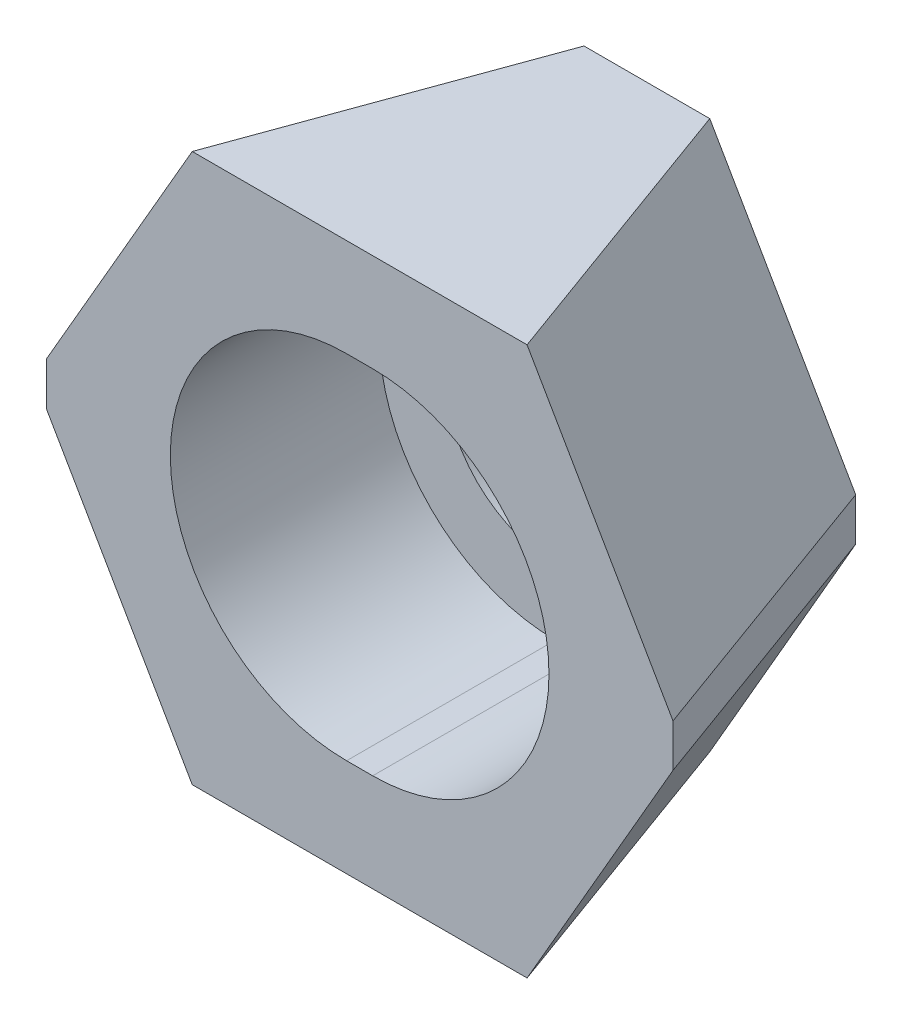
ISO-10303-21;
HEADER;
FILE_DESCRIPTION(('STEP AP214'),'2;1');
FILE_NAME('part.step','',(''),(''),'','','');
FILE_SCHEMA(('AUTOMOTIVE_DESIGN { 1 0 10303 214 1 1 1 1 }'));
ENDSEC;
DATA;
#1=APPLICATION_CONTEXT('core data for automotive mechanical design processes');
#2=APPLICATION_PROTOCOL_DEFINITION('international standard','automotive_design',2000,#1);
#3=PRODUCT_CONTEXT('',#1,'mechanical');
#4=PRODUCT('Part','Part','',(#3));
#5=PRODUCT_RELATED_PRODUCT_CATEGORY('part','',(#4));
#6=PRODUCT_DEFINITION_FORMATION('','',#4);
#7=PRODUCT_DEFINITION_CONTEXT('part definition',#1,'design');
#8=PRODUCT_DEFINITION('design','',#6,#7);
#9=PRODUCT_DEFINITION_SHAPE('','',#8);
#10=(LENGTH_UNIT() NAMED_UNIT(*) SI_UNIT(.MILLI.,.METRE.));
#11=(NAMED_UNIT(*) PLANE_ANGLE_UNIT() SI_UNIT($,.RADIAN.));
#12=(NAMED_UNIT(*) SI_UNIT($,.STERADIAN.) SOLID_ANGLE_UNIT());
#13=UNCERTAINTY_MEASURE_WITH_UNIT(LENGTH_MEASURE(1.E-05),#10,'distance_accuracy_value','');
#14=(GEOMETRIC_REPRESENTATION_CONTEXT(3) GLOBAL_UNCERTAINTY_ASSIGNED_CONTEXT((#13)) GLOBAL_UNIT_ASSIGNED_CONTEXT((#10,
#11,#12)) REPRESENTATION_CONTEXT('',''));
#15=CARTESIAN_POINT('',(0.,0.,0.));
#16=DIRECTION('',(0.,0.,1.));
#17=DIRECTION('',(1.,0.,0.));
#18=AXIS2_PLACEMENT_3D('',#15,#16,#17);
#19=CARTESIAN_POINT('',(13.,10.5,11.));
#20=DIRECTION('',(0.,0.,1.));
#21=DIRECTION('',(1.,0.,0.));
#22=AXIS2_PLACEMENT_3D('',#19,#20,#21);
#23=PLANE('',#22);
#24=DIRECTION('',(-1.,0.,0.));
#25=VECTOR('',#24,1.);
#26=CARTESIAN_POINT('',(-0.5,6.75,11.));
#27=LINE('',#26,#25);
#28=CARTESIAN_POINT('',(0.5,6.75,11.));
#29=VERTEX_POINT('',#28);
#30=CARTESIAN_POINT('',(-0.5,6.75,11.));
#31=VERTEX_POINT('',#30);
#32=EDGE_CURVE('E189',#29,#31,#27,.T.);
#33=ORIENTED_EDGE('',*,*,#32,.F.);
#34=CARTESIAN_POINT('',(0.5,0.,11.));
#35=DIRECTION('',(0.,0.,1.));
#36=DIRECTION('',(1.,0.,0.));
#37=AXIS2_PLACEMENT_3D('',#34,#35,#36);
#38=CIRCLE('',#37,6.75);
#39=CARTESIAN_POINT('',(0.5,-6.75,11.));
#40=VERTEX_POINT('',#39);
#41=EDGE_CURVE('E186',#40,#29,#38,.T.);
#42=ORIENTED_EDGE('',*,*,#41,.F.);
#43=DIRECTION('',(1.,0.,0.));
#44=VECTOR('',#43,1.);
#45=CARTESIAN_POINT('',(-0.5,-6.75,11.));
#46=LINE('',#45,#44);
#47=CARTESIAN_POINT('',(-0.5,-6.75,11.));
#48=VERTEX_POINT('',#47);
#49=EDGE_CURVE('E184',#48,#40,#46,.T.);
#50=ORIENTED_EDGE('',*,*,#49,.F.);
#51=CARTESIAN_POINT('',(-0.5,0.,11.));
#52=DIRECTION('',(0.,0.,1.));
#53=DIRECTION('',(1.,0.,0.));
#54=AXIS2_PLACEMENT_3D('',#51,#52,#53);
#55=CIRCLE('',#54,6.75);
#56=EDGE_CURVE('E168',#31,#48,#55,.T.);
#57=ORIENTED_EDGE('',*,*,#56,.F.);
#58=EDGE_LOOP('',(#33,#42,#50,#57));
#59=FACE_BOUND('',#58,.T.);
#60=DIRECTION('',(0.5,-0.86602540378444,0.));
#61=VECTOR('',#60,1.);
#62=CARTESIAN_POINT('',(6.41124939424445,10.5,11.));
#63=LINE('',#62,#61);
#64=CARTESIAN_POINT('',(6.41124939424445,10.5,11.));
#65=VERTEX_POINT('',#64);
#66=CARTESIAN_POINT('',(12.,0.82,11.));
#67=VERTEX_POINT('',#66);
#68=EDGE_CURVE('E212',#65,#67,#63,.T.);
#69=ORIENTED_EDGE('',*,*,#68,.F.);
#70=DIRECTION('',(-1.,0.,0.));
#71=VECTOR('',#70,1.);
#72=CARTESIAN_POINT('',(13.,10.5,11.));
#73=LINE('',#72,#71);
#74=CARTESIAN_POINT('',(-6.41124939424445,10.5,11.));
#75=VERTEX_POINT('',#74);
#76=EDGE_CURVE('E18',#65,#75,#73,.T.);
#77=ORIENTED_EDGE('',*,*,#76,.T.);
#78=DIRECTION('',(-0.5,-0.86602540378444,0.));
#79=VECTOR('',#78,1.);
#80=CARTESIAN_POINT('',(-6.41124939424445,10.5,11.));
#81=LINE('',#80,#79);
#82=CARTESIAN_POINT('',(-12.,0.82,11.));
#83=VERTEX_POINT('',#82);
#84=EDGE_CURVE('E211',#75,#83,#81,.T.);
#85=ORIENTED_EDGE('',*,*,#84,.T.);
#86=DIRECTION('',(0.,1.,0.));
#87=VECTOR('',#86,1.);
#88=CARTESIAN_POINT('',(-12.,-0.82,11.));
#89=LINE('',#88,#87);
#90=CARTESIAN_POINT('',(-12.,-0.82,11.));
#91=VERTEX_POINT('',#90);
#92=EDGE_CURVE('E238',#91,#83,#89,.T.);
#93=ORIENTED_EDGE('',*,*,#92,.F.);
#94=DIRECTION('',(-0.5,0.86602540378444,0.));
#95=VECTOR('',#94,1.);
#96=CARTESIAN_POINT('',(-6.41124939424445,-10.5,11.));
#97=LINE('',#96,#95);
#98=CARTESIAN_POINT('',(-6.41124939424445,-10.5,11.));
#99=VERTEX_POINT('',#98);
#100=EDGE_CURVE('E234',#99,#91,#97,.T.);
#101=ORIENTED_EDGE('',*,*,#100,.F.);
#102=DIRECTION('',(-1.,0.,0.));
#103=VECTOR('',#102,1.);
#104=CARTESIAN_POINT('',(13.,-10.5,11.));
#105=LINE('',#104,#103);
#106=CARTESIAN_POINT('',(6.41124939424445,-10.5,11.));
#107=VERTEX_POINT('',#106);
#108=EDGE_CURVE('E233',#107,#99,#105,.T.);
#109=ORIENTED_EDGE('',*,*,#108,.F.);
#110=DIRECTION('',(0.5,0.86602540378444,0.));
#111=VECTOR('',#110,1.);
#112=CARTESIAN_POINT('',(6.41124939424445,-10.5,11.));
#113=LINE('',#112,#111);
#114=CARTESIAN_POINT('',(12.,-0.82,11.));
#115=VERTEX_POINT('',#114);
#116=EDGE_CURVE('E29',#107,#115,#113,.T.);
#117=ORIENTED_EDGE('',*,*,#116,.T.);
#118=DIRECTION('',(0.,-1.,0.));
#119=VECTOR('',#118,1.);
#120=CARTESIAN_POINT('',(12.,0.82,11.));
#121=LINE('',#120,#119);
#122=EDGE_CURVE('E216',#67,#115,#121,.T.);
#123=ORIENTED_EDGE('',*,*,#122,.F.);
#124=EDGE_LOOP('',(#69,#77,#85,#93,#101,#109,#117,#123));
#125=FACE_BOUND('',#124,.T.);
#126=ADVANCED_FACE('F14',(#59,#125),#23,.T.);
#127=CARTESIAN_POINT('',(-8.99632742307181,10.5,0.));
#128=DIRECTION('',(0.,0.,-1.));
#129=DIRECTION('',(-1.,0.,0.));
#130=AXIS2_PLACEMENT_3D('',#127,#128,#129);
#131=PLANE('',#130);
#132=CARTESIAN_POINT('',(-0.5,0.,0.));
#133=DIRECTION('',(0.,0.,1.));
#134=DIRECTION('',(1.,0.,0.));
#135=AXIS2_PLACEMENT_3D('',#132,#133,#134);
#136=CIRCLE('',#135,4.25);
#137=CARTESIAN_POINT('',(-0.5,4.25,0.));
#138=VERTEX_POINT('',#137);
#139=CARTESIAN_POINT('',(-0.5,-4.25,0.));
#140=VERTEX_POINT('',#139);
#141=EDGE_CURVE('E134',#138,#140,#136,.T.);
#142=ORIENTED_EDGE('',*,*,#141,.T.);
#143=DIRECTION('',(1.,0.,0.));
#144=VECTOR('',#143,1.);
#145=CARTESIAN_POINT('',(-0.5,-4.25,0.));
#146=LINE('',#145,#144);
#147=CARTESIAN_POINT('',(0.5,-4.25,0.));
#148=VERTEX_POINT('',#147);
#149=EDGE_CURVE('E143',#140,#148,#146,.T.);
#150=ORIENTED_EDGE('',*,*,#149,.T.);
#151=CARTESIAN_POINT('',(0.5,0.,0.));
#152=DIRECTION('',(0.,0.,1.));
#153=DIRECTION('',(1.,0.,0.));
#154=AXIS2_PLACEMENT_3D('',#151,#152,#153);
#155=CIRCLE('',#154,4.25);
#156=CARTESIAN_POINT('',(0.5,4.25,0.));
#157=VERTEX_POINT('',#156);
#158=EDGE_CURVE('E149',#148,#157,#155,.T.);
#159=ORIENTED_EDGE('',*,*,#158,.T.);
#160=DIRECTION('',(-1.,0.,0.));
#161=VECTOR('',#160,1.);
#162=CARTESIAN_POINT('',(-0.5,4.25,0.));
#163=LINE('',#162,#161);
#164=EDGE_CURVE('E140',#157,#138,#163,.T.);
#165=ORIENTED_EDGE('',*,*,#164,.T.);
#166=EDGE_LOOP('',(#142,#150,#159,#165));
#167=FACE_BOUND('',#166,.T.);
#168=DIRECTION('',(0.5,-0.86602540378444,0.));
#169=VECTOR('',#168,1.);
#170=CARTESIAN_POINT('',(-1.41632463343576,17.1231915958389,0.));
#171=LINE('',#170,#169);
#172=CARTESIAN_POINT('',(2.40757681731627,10.5,0.));
#173=VERTEX_POINT('',#172);
#174=CARTESIAN_POINT('',(7.99632742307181,0.82,0.));
#175=VERTEX_POINT('',#174);
#176=EDGE_CURVE('E208',#173,#175,#171,.T.);
#177=ORIENTED_EDGE('',*,*,#176,.T.);
#178=DIRECTION('',(0.,-1.,0.));
#179=VECTOR('',#178,1.);
#180=CARTESIAN_POINT('',(7.99632742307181,0.82,0.));
#181=LINE('',#180,#179);
#182=CARTESIAN_POINT('',(7.99632742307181,-0.82,0.));
#183=VERTEX_POINT('',#182);
#184=EDGE_CURVE('E204',#175,#183,#181,.T.);
#185=ORIENTED_EDGE('',*,*,#184,.T.);
#186=DIRECTION('',(0.5,0.86602540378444,0.));
#187=VECTOR('',#186,1.);
#188=CARTESIAN_POINT('',(-1.41632463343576,-17.1231915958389,0.));
#189=LINE('',#188,#187);
#190=CARTESIAN_POINT('',(2.40757681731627,-10.5,0.));
#191=VERTEX_POINT('',#190);
#192=EDGE_CURVE('E202',#191,#183,#189,.T.);
#193=ORIENTED_EDGE('',*,*,#192,.F.);
#194=DIRECTION('',(1.,0.,0.));
#195=VECTOR('',#194,1.);
#196=CARTESIAN_POINT('',(-8.99632742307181,-10.5,0.));
#197=LINE('',#196,#195);
#198=CARTESIAN_POINT('',(-2.40757681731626,-10.5,0.));
#199=VERTEX_POINT('',#198);
#200=EDGE_CURVE('E250',#199,#191,#197,.T.);
#201=ORIENTED_EDGE('',*,*,#200,.F.);
#202=DIRECTION('',(-0.5,0.86602540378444,0.));
#203=VECTOR('',#202,1.);
#204=CARTESIAN_POINT('',(1.41632463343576,-17.1231915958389,0.));
#205=LINE('',#204,#203);
#206=CARTESIAN_POINT('',(-7.99632742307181,-0.82,0.));
#207=VERTEX_POINT('',#206);
#208=EDGE_CURVE('E37',#199,#207,#205,.T.);
#209=ORIENTED_EDGE('',*,*,#208,.T.);
#210=DIRECTION('',(0.,1.,0.));
#211=VECTOR('',#210,1.);
#212=CARTESIAN_POINT('',(-7.99632742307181,-0.82,0.));
#213=LINE('',#212,#211);
#214=CARTESIAN_POINT('',(-7.99632742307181,0.82,0.));
#215=VERTEX_POINT('',#214);
#216=EDGE_CURVE('E228',#207,#215,#213,.T.);
#217=ORIENTED_EDGE('',*,*,#216,.T.);
#218=DIRECTION('',(-0.5,-0.86602540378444,0.));
#219=VECTOR('',#218,1.);
#220=CARTESIAN_POINT('',(1.41632463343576,17.1231915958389,0.));
#221=LINE('',#220,#219);
#222=CARTESIAN_POINT('',(-2.40757681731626,10.5,0.));
#223=VERTEX_POINT('',#222);
#224=EDGE_CURVE('E226',#223,#215,#221,.T.);
#225=ORIENTED_EDGE('',*,*,#224,.F.);
#226=DIRECTION('',(1.,0.,0.));
#227=VECTOR('',#226,1.);
#228=CARTESIAN_POINT('',(-8.99632742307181,10.5,0.));
#229=LINE('',#228,#227);
#230=EDGE_CURVE('E9',#223,#173,#229,.T.);
#231=ORIENTED_EDGE('',*,*,#230,.T.);
#232=EDGE_LOOP('',(#177,#185,#193,#201,#209,#217,#225,#231));
#233=FACE_BOUND('',#232,.T.);
#234=ADVANCED_FACE('F16',(#167,#233),#131,.T.);
#235=CARTESIAN_POINT('',(-13.,10.5,11.));
#236=DIRECTION('',(0.,-1.,0.));
#237=DIRECTION('',(0.,0.,-1.));
#238=AXIS2_PLACEMENT_3D('',#235,#236,#237);
#239=PLANE('',#238);
#240=DIRECTION('',(-0.342020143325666,0.,0.939692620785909));
#241=VECTOR('',#240,1.);
#242=CARTESIAN_POINT('',(12.888028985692,10.5,-42.0243315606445));
#243=LINE('',#242,#241);
#244=EDGE_CURVE('E229',#223,#75,#243,.T.);
#245=ORIENTED_EDGE('',*,*,#244,.T.);
#246=ORIENTED_EDGE('',*,*,#76,.F.);
#247=DIRECTION('',(0.342020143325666,0.,0.939692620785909));
#248=VECTOR('',#247,1.);
#249=CARTESIAN_POINT('',(-12.8880289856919,10.5,-42.0243315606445));
#250=LINE('',#249,#248);
#251=EDGE_CURVE('E215',#173,#65,#250,.T.);
#252=ORIENTED_EDGE('',*,*,#251,.F.);
#253=ORIENTED_EDGE('',*,*,#230,.F.);
#254=EDGE_LOOP('',(#245,#246,#252,#253));
#255=FACE_BOUND('',#254,.T.);
#256=ADVANCED_FACE('F278',(#255),#239,.F.);
#257=CARTESIAN_POINT('',(-13.,-10.5,11.));
#258=DIRECTION('',(0.,-1.,0.));
#259=DIRECTION('',(0.,0.,-1.));
#260=AXIS2_PLACEMENT_3D('',#257,#258,#259);
#261=PLANE('',#260);
#262=ORIENTED_EDGE('',*,*,#108,.T.);
#263=DIRECTION('',(-0.342020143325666,0.,0.939692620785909));
#264=VECTOR('',#263,1.);
#265=CARTESIAN_POINT('',(12.888028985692,-10.5,-42.0243315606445));
#266=LINE('',#265,#264);
#267=EDGE_CURVE('E237',#199,#99,#266,.T.);
#268=ORIENTED_EDGE('',*,*,#267,.F.);
#269=ORIENTED_EDGE('',*,*,#200,.T.);
#270=DIRECTION('',(0.342020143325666,0.,0.939692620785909));
#271=VECTOR('',#270,1.);
#272=CARTESIAN_POINT('',(-12.8880289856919,-10.5,-42.0243315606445));
#273=LINE('',#272,#271);
#274=EDGE_CURVE('E205',#191,#107,#273,.T.);
#275=ORIENTED_EDGE('',*,*,#274,.T.);
#276=EDGE_LOOP('',(#262,#268,#269,#275));
#277=FACE_BOUND('',#276,.T.);
#278=ADVANCED_FACE('F255',(#277),#261,.T.);
#279=CARTESIAN_POINT('',(12.888028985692,-10.5,-42.0243315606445));
#280=DIRECTION('',(0.825964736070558,0.476870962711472,0.30062657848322));
#281=DIRECTION('',(-0.5,0.86602540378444,0.));
#282=AXIS2_PLACEMENT_3D('',#279,#280,#281);
#283=PLANE('',#282);
#284=ORIENTED_EDGE('',*,*,#267,.T.);
#285=ORIENTED_EDGE('',*,*,#100,.T.);
#286=DIRECTION('',(-0.342020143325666,0.,0.939692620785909));
#287=VECTOR('',#286,1.);
#288=CARTESIAN_POINT('',(7.29927837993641,-0.82,-42.0243315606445));
#289=LINE('',#288,#287);
#290=EDGE_CURVE('E244',#207,#91,#289,.T.);
#291=ORIENTED_EDGE('',*,*,#290,.F.);
#292=ORIENTED_EDGE('',*,*,#208,.F.);
#293=EDGE_LOOP('',(#284,#285,#291,#292));
#294=FACE_BOUND('',#293,.T.);
#295=ADVANCED_FACE('F259',(#294),#283,.F.);
#296=CARTESIAN_POINT('',(7.29927837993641,-0.82,-42.0243315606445));
#297=DIRECTION('',(0.939692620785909,0.,0.342020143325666));
#298=DIRECTION('',(0.342020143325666,0.,-0.939692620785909));
#299=AXIS2_PLACEMENT_3D('',#296,#297,#298);
#300=PLANE('',#299);
#301=ORIENTED_EDGE('',*,*,#290,.T.);
#302=ORIENTED_EDGE('',*,*,#92,.T.);
#303=DIRECTION('',(-0.342020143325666,0.,0.939692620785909));
#304=VECTOR('',#303,1.);
#305=CARTESIAN_POINT('',(7.29927837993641,0.82,-42.0243315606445));
#306=LINE('',#305,#304);
#307=EDGE_CURVE('E246',#215,#83,#306,.T.);
#308=ORIENTED_EDGE('',*,*,#307,.F.);
#309=ORIENTED_EDGE('',*,*,#216,.F.);
#310=EDGE_LOOP('',(#301,#302,#308,#309));
#311=FACE_BOUND('',#310,.T.);
#312=ADVANCED_FACE('F265',(#311),#300,.F.);
#313=CARTESIAN_POINT('',(12.888028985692,10.5,-42.0243315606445));
#314=DIRECTION('',(-0.825964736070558,0.476870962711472,-0.30062657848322));
#315=DIRECTION('',(-0.5,-0.86602540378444,0.));
#316=AXIS2_PLACEMENT_3D('',#313,#314,#315);
#317=PLANE('',#316);
#318=ORIENTED_EDGE('',*,*,#224,.T.);
#319=ORIENTED_EDGE('',*,*,#307,.T.);
#320=ORIENTED_EDGE('',*,*,#84,.F.);
#321=ORIENTED_EDGE('',*,*,#244,.F.);
#322=EDGE_LOOP('',(#318,#319,#320,#321));
#323=FACE_BOUND('',#322,.T.);
#324=ADVANCED_FACE('F281',(#323),#317,.T.);
#325=CARTESIAN_POINT('',(-12.8880289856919,10.5,-42.0243315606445));
#326=DIRECTION('',(-0.825964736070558,-0.476870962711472,0.30062657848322));
#327=DIRECTION('',(0.5,-0.86602540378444,0.));
#328=AXIS2_PLACEMENT_3D('',#325,#326,#327);
#329=PLANE('',#328);
#330=ORIENTED_EDGE('',*,*,#251,.T.);
#331=ORIENTED_EDGE('',*,*,#68,.T.);
#332=DIRECTION('',(0.342020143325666,0.,0.939692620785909));
#333=VECTOR('',#332,1.);
#334=CARTESIAN_POINT('',(-7.2992783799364,0.82,-42.0243315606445));
#335=LINE('',#334,#333);
#336=EDGE_CURVE('E221',#175,#67,#335,.T.);
#337=ORIENTED_EDGE('',*,*,#336,.F.);
#338=ORIENTED_EDGE('',*,*,#176,.F.);
#339=EDGE_LOOP('',(#330,#331,#337,#338));
#340=FACE_BOUND('',#339,.T.);
#341=ADVANCED_FACE('F282',(#340),#329,.F.);
#342=CARTESIAN_POINT('',(-7.2992783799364,0.82,-42.0243315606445));
#343=DIRECTION('',(-0.939692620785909,0.,0.342020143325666));
#344=DIRECTION('',(0.342020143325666,0.,0.939692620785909));
#345=AXIS2_PLACEMENT_3D('',#342,#343,#344);
#346=PLANE('',#345);
#347=ORIENTED_EDGE('',*,*,#336,.T.);
#348=ORIENTED_EDGE('',*,*,#122,.T.);
#349=DIRECTION('',(0.342020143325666,0.,0.939692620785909));
#350=VECTOR('',#349,1.);
#351=CARTESIAN_POINT('',(-7.2992783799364,-0.82,-42.0243315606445));
#352=LINE('',#351,#350);
#353=EDGE_CURVE('E223',#183,#115,#352,.T.);
#354=ORIENTED_EDGE('',*,*,#353,.F.);
#355=ORIENTED_EDGE('',*,*,#184,.F.);
#356=EDGE_LOOP('',(#347,#348,#354,#355));
#357=FACE_BOUND('',#356,.T.);
#358=ADVANCED_FACE('F271',(#357),#346,.F.);
#359=CARTESIAN_POINT('',(-12.8880289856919,-10.5,-42.0243315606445));
#360=DIRECTION('',(0.825964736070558,-0.476870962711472,-0.30062657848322));
#361=DIRECTION('',(0.5,0.86602540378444,0.));
#362=AXIS2_PLACEMENT_3D('',#359,#360,#361);
#363=PLANE('',#362);
#364=ORIENTED_EDGE('',*,*,#192,.T.);
#365=ORIENTED_EDGE('',*,*,#353,.T.);
#366=ORIENTED_EDGE('',*,*,#116,.F.);
#367=ORIENTED_EDGE('',*,*,#274,.F.);
#368=EDGE_LOOP('',(#364,#365,#366,#367));
#369=FACE_BOUND('',#368,.T.);
#370=ADVANCED_FACE('F269',(#369),#363,.T.);
#371=CARTESIAN_POINT('',(4.25,0.,3.));
#372=DIRECTION('',(0.,0.,1.));
#373=DIRECTION('',(1.,0.,0.));
#374=AXIS2_PLACEMENT_3D('',#371,#372,#373);
#375=PLANE('',#374);
#376=DIRECTION('',(-1.,0.,0.));
#377=VECTOR('',#376,1.);
#378=CARTESIAN_POINT('',(-0.5,4.25,3.));
#379=LINE('',#378,#377);
#380=CARTESIAN_POINT('',(0.5,4.25,3.));
#381=VERTEX_POINT('',#380);
#382=CARTESIAN_POINT('',(-0.5,4.25,3.));
#383=VERTEX_POINT('',#382);
#384=EDGE_CURVE('E154',#381,#383,#379,.T.);
#385=ORIENTED_EDGE('',*,*,#384,.F.);
#386=CARTESIAN_POINT('',(0.5,0.,3.));
#387=DIRECTION('',(0.,0.,1.));
#388=DIRECTION('',(1.,0.,0.));
#389=AXIS2_PLACEMENT_3D('',#386,#387,#388);
#390=CIRCLE('',#389,4.25);
#391=CARTESIAN_POINT('',(0.5,-4.25,3.));
#392=VERTEX_POINT('',#391);
#393=EDGE_CURVE('E156',#392,#381,#390,.T.);
#394=ORIENTED_EDGE('',*,*,#393,.F.);
#395=DIRECTION('',(1.,0.,0.));
#396=VECTOR('',#395,1.);
#397=CARTESIAN_POINT('',(-0.5,-4.25,3.));
#398=LINE('',#397,#396);
#399=CARTESIAN_POINT('',(-0.5,-4.25,3.));
#400=VERTEX_POINT('',#399);
#401=EDGE_CURVE('E162',#400,#392,#398,.T.);
#402=ORIENTED_EDGE('',*,*,#401,.F.);
#403=CARTESIAN_POINT('',(-0.5,0.,3.));
#404=DIRECTION('',(0.,0.,1.));
#405=DIRECTION('',(1.,0.,0.));
#406=AXIS2_PLACEMENT_3D('',#403,#404,#405);
#407=CIRCLE('',#406,4.25);
#408=EDGE_CURVE('E136',#383,#400,#407,.T.);
#409=ORIENTED_EDGE('',*,*,#408,.F.);
#410=EDGE_LOOP('',(#385,#394,#402,#409));
#411=FACE_BOUND('',#410,.T.);
#412=CARTESIAN_POINT('',(0.5,0.,3.));
#413=DIRECTION('',(0.,0.,1.));
#414=DIRECTION('',(1.,0.,0.));
#415=AXIS2_PLACEMENT_3D('',#412,#413,#414);
#416=CIRCLE('',#415,6.75);
#417=CARTESIAN_POINT('',(0.5,6.75,3.));
#418=VERTEX_POINT('',#417);
#419=CARTESIAN_POINT('',(0.5,-6.75,3.));
#420=VERTEX_POINT('',#419);
#421=EDGE_CURVE('E173',#418,#420,#416,.F.);
#422=ORIENTED_EDGE('',*,*,#421,.F.);
#423=DIRECTION('',(1.,0.,0.));
#424=VECTOR('',#423,1.);
#425=CARTESIAN_POINT('',(-0.5,6.75,3.));
#426=LINE('',#425,#424);
#427=CARTESIAN_POINT('',(-0.5,6.75,3.));
#428=VERTEX_POINT('',#427);
#429=EDGE_CURVE('E176',#428,#418,#426,.T.);
#430=ORIENTED_EDGE('',*,*,#429,.F.);
#431=CARTESIAN_POINT('',(-0.5,0.,3.));
#432=DIRECTION('',(0.,0.,1.));
#433=DIRECTION('',(1.,0.,0.));
#434=AXIS2_PLACEMENT_3D('',#431,#432,#433);
#435=CIRCLE('',#434,6.75);
#436=CARTESIAN_POINT('',(-0.5,-6.75,3.));
#437=VERTEX_POINT('',#436);
#438=EDGE_CURVE('E179',#437,#428,#435,.F.);
#439=ORIENTED_EDGE('',*,*,#438,.F.);
#440=DIRECTION('',(-1.,0.,0.));
#441=VECTOR('',#440,1.);
#442=CARTESIAN_POINT('',(-0.5,-6.75,3.));
#443=LINE('',#442,#441);
#444=EDGE_CURVE('E181',#420,#437,#443,.T.);
#445=ORIENTED_EDGE('',*,*,#444,.F.);
#446=EDGE_LOOP('',(#422,#430,#439,#445));
#447=FACE_BOUND('',#446,.T.);
#448=ADVANCED_FACE('F310',(#411,#447),#375,.T.);
#449=CARTESIAN_POINT('',(-0.5,6.75,-16.8116127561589));
#450=DIRECTION('',(0.,1.,0.));
#451=DIRECTION('',(0.,0.,1.));
#452=AXIS2_PLACEMENT_3D('',#449,#450,#451);
#453=PLANE('',#452);
#454=ORIENTED_EDGE('',*,*,#429,.T.);
#455=DIRECTION('',(0.,0.,1.));
#456=VECTOR('',#455,1.);
#457=CARTESIAN_POINT('',(0.5,6.75,-16.8116127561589));
#458=LINE('',#457,#456);
#459=EDGE_CURVE('E194',#418,#29,#458,.T.);
#460=ORIENTED_EDGE('',*,*,#459,.T.);
#461=ORIENTED_EDGE('',*,*,#32,.T.);
#462=DIRECTION('',(0.,0.,1.));
#463=VECTOR('',#462,1.);
#464=CARTESIAN_POINT('',(-0.5,6.75,-16.8116127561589));
#465=LINE('',#464,#463);
#466=EDGE_CURVE('E177',#428,#31,#465,.T.);
#467=ORIENTED_EDGE('',*,*,#466,.F.);
#468=EDGE_LOOP('',(#454,#460,#461,#467));
#469=FACE_BOUND('',#468,.T.);
#470=ADVANCED_FACE('F315',(#469),#453,.F.);
#471=CARTESIAN_POINT('',(-0.5,-6.75,-16.8116127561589));
#472=DIRECTION('',(0.,-1.,0.));
#473=DIRECTION('',(0.,0.,-1.));
#474=AXIS2_PLACEMENT_3D('',#471,#472,#473);
#475=PLANE('',#474);
#476=ORIENTED_EDGE('',*,*,#444,.T.);
#477=DIRECTION('',(0.,0.,1.));
#478=VECTOR('',#477,1.);
#479=CARTESIAN_POINT('',(-0.5,-6.75,-16.8116127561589));
#480=LINE('',#479,#478);
#481=EDGE_CURVE('E191',#437,#48,#480,.T.);
#482=ORIENTED_EDGE('',*,*,#481,.T.);
#483=ORIENTED_EDGE('',*,*,#49,.T.);
#484=DIRECTION('',(0.,0.,1.));
#485=VECTOR('',#484,1.);
#486=CARTESIAN_POINT('',(0.5,-6.75,-16.8116127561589));
#487=LINE('',#486,#485);
#488=EDGE_CURVE('E197',#420,#40,#487,.T.);
#489=ORIENTED_EDGE('',*,*,#488,.F.);
#490=EDGE_LOOP('',(#476,#482,#483,#489));
#491=FACE_BOUND('',#490,.T.);
#492=ADVANCED_FACE('F321',(#491),#475,.F.);
#493=CARTESIAN_POINT('',(-0.5,0.,-16.8116127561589));
#494=DIRECTION('',(0.,0.,1.));
#495=DIRECTION('',(1.,0.,0.));
#496=AXIS2_PLACEMENT_3D('',#493,#494,#495);
#497=CYLINDRICAL_SURFACE('',#496,6.75);
#498=ORIENTED_EDGE('',*,*,#438,.T.);
#499=ORIENTED_EDGE('',*,*,#466,.T.);
#500=ORIENTED_EDGE('',*,*,#56,.T.);
#501=ORIENTED_EDGE('',*,*,#481,.F.);
#502=EDGE_LOOP('',(#498,#499,#500,#501));
#503=FACE_BOUND('',#502,.T.);
#504=ADVANCED_FACE('F326',(#503),#497,.F.);
#505=CARTESIAN_POINT('',(0.5,0.,-16.8116127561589));
#506=DIRECTION('',(0.,0.,1.));
#507=DIRECTION('',(1.,0.,0.));
#508=AXIS2_PLACEMENT_3D('',#505,#506,#507);
#509=CYLINDRICAL_SURFACE('',#508,6.75);
#510=ORIENTED_EDGE('',*,*,#421,.T.);
#511=ORIENTED_EDGE('',*,*,#488,.T.);
#512=ORIENTED_EDGE('',*,*,#41,.T.);
#513=ORIENTED_EDGE('',*,*,#459,.F.);
#514=EDGE_LOOP('',(#510,#511,#512,#513));
#515=FACE_BOUND('',#514,.T.);
#516=ADVANCED_FACE('F329',(#515),#509,.F.);
#517=CARTESIAN_POINT('',(-0.5,4.25,0.));
#518=DIRECTION('',(0.,1.,0.));
#519=DIRECTION('',(0.,0.,1.));
#520=AXIS2_PLACEMENT_3D('',#517,#518,#519);
#521=PLANE('',#520);
#522=ORIENTED_EDGE('',*,*,#164,.F.);
#523=DIRECTION('',(0.,0.,1.));
#524=VECTOR('',#523,1.);
#525=CARTESIAN_POINT('',(0.5,4.25,0.));
#526=LINE('',#525,#524);
#527=EDGE_CURVE('E169',#157,#381,#526,.T.);
#528=ORIENTED_EDGE('',*,*,#527,.T.);
#529=ORIENTED_EDGE('',*,*,#384,.T.);
#530=DIRECTION('',(0.,0.,1.));
#531=VECTOR('',#530,1.);
#532=CARTESIAN_POINT('',(-0.5,4.25,0.));
#533=LINE('',#532,#531);
#534=EDGE_CURVE('E166',#138,#383,#533,.T.);
#535=ORIENTED_EDGE('',*,*,#534,.F.);
#536=EDGE_LOOP('',(#522,#528,#529,#535));
#537=FACE_BOUND('',#536,.T.);
#538=ADVANCED_FACE('F335',(#537),#521,.F.);
#539=CARTESIAN_POINT('',(-0.5,-4.25,0.));
#540=DIRECTION('',(0.,-1.,0.));
#541=DIRECTION('',(0.,0.,-1.));
#542=AXIS2_PLACEMENT_3D('',#539,#540,#541);
#543=PLANE('',#542);
#544=ORIENTED_EDGE('',*,*,#149,.F.);
#545=DIRECTION('',(0.,0.,1.));
#546=VECTOR('',#545,1.);
#547=CARTESIAN_POINT('',(-0.5,-4.25,0.));
#548=LINE('',#547,#546);
#549=EDGE_CURVE('E129',#140,#400,#548,.T.);
#550=ORIENTED_EDGE('',*,*,#549,.T.);
#551=ORIENTED_EDGE('',*,*,#401,.T.);
#552=DIRECTION('',(0.,0.,1.));
#553=VECTOR('',#552,1.);
#554=CARTESIAN_POINT('',(0.5,-4.25,0.));
#555=LINE('',#554,#553);
#556=EDGE_CURVE('E139',#148,#392,#555,.T.);
#557=ORIENTED_EDGE('',*,*,#556,.F.);
#558=EDGE_LOOP('',(#544,#550,#551,#557));
#559=FACE_BOUND('',#558,.T.);
#560=ADVANCED_FACE('F144',(#559),#543,.F.);
#561=CARTESIAN_POINT('',(-0.5,0.,0.));
#562=DIRECTION('',(0.,0.,1.));
#563=DIRECTION('',(1.,0.,0.));
#564=AXIS2_PLACEMENT_3D('',#561,#562,#563);
#565=CYLINDRICAL_SURFACE('',#564,4.25);
#566=ORIENTED_EDGE('',*,*,#408,.T.);
#567=ORIENTED_EDGE('',*,*,#549,.F.);
#568=ORIENTED_EDGE('',*,*,#141,.F.);
#569=ORIENTED_EDGE('',*,*,#534,.T.);
#570=EDGE_LOOP('',(#566,#567,#568,#569));
#571=FACE_BOUND('',#570,.T.);
#572=ADVANCED_FACE('F131',(#571),#565,.F.);
#573=CARTESIAN_POINT('',(0.5,0.,0.));
#574=DIRECTION('',(0.,0.,1.));
#575=DIRECTION('',(1.,0.,0.));
#576=AXIS2_PLACEMENT_3D('',#573,#574,#575);
#577=CYLINDRICAL_SURFACE('',#576,4.25);
#578=ORIENTED_EDGE('',*,*,#393,.T.);
#579=ORIENTED_EDGE('',*,*,#527,.F.);
#580=ORIENTED_EDGE('',*,*,#158,.F.);
#581=ORIENTED_EDGE('',*,*,#556,.T.);
#582=EDGE_LOOP('',(#578,#579,#580,#581));
#583=FACE_BOUND('',#582,.T.);
#584=ADVANCED_FACE('F340',(#583),#577,.F.);
#585=CLOSED_SHELL('',(#126,#234,#256,#278,#295,#312,#324,#341,#358,#370,#448,#470,#492,#504,
#516,#538,#560,#572,#584));
#586=MANIFOLD_SOLID_BREP('B1',#585);
#587=ADVANCED_BREP_SHAPE_REPRESENTATION('',(#18,#586),#14);
#588=SHAPE_DEFINITION_REPRESENTATION(#9,#587);
ENDSEC;
END-ISO-10303-21;
